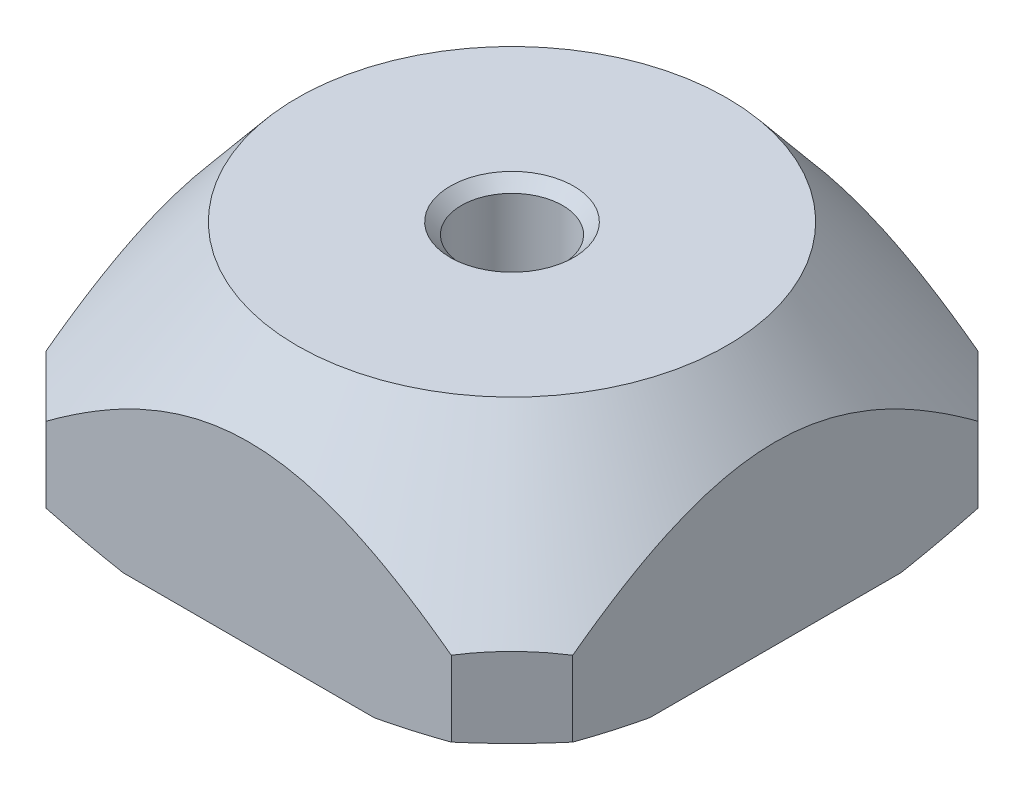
ISO-10303-21;
HEADER;
FILE_DESCRIPTION(('STEP AP214'),'2;1');
FILE_NAME('part.step','',(''),(''),'','','');
FILE_SCHEMA(('AUTOMOTIVE_DESIGN { 1 0 10303 214 1 1 1 1 }'));
ENDSEC;
DATA;
#1=APPLICATION_CONTEXT('core data for automotive mechanical design processes');
#2=APPLICATION_PROTOCOL_DEFINITION('international standard','automotive_design',2000,#1);
#3=PRODUCT_CONTEXT('',#1,'mechanical');
#4=PRODUCT('Part','Part','',(#3));
#5=PRODUCT_RELATED_PRODUCT_CATEGORY('part','',(#4));
#6=PRODUCT_DEFINITION_FORMATION('','',#4);
#7=PRODUCT_DEFINITION_CONTEXT('part definition',#1,'design');
#8=PRODUCT_DEFINITION('design','',#6,#7);
#9=PRODUCT_DEFINITION_SHAPE('','',#8);
#10=(LENGTH_UNIT() NAMED_UNIT(*) SI_UNIT(.MILLI.,.METRE.));
#11=(NAMED_UNIT(*) PLANE_ANGLE_UNIT() SI_UNIT($,.RADIAN.));
#12=(NAMED_UNIT(*) SI_UNIT($,.STERADIAN.) SOLID_ANGLE_UNIT());
#13=UNCERTAINTY_MEASURE_WITH_UNIT(LENGTH_MEASURE(1.E-05),#10,'distance_accuracy_value','');
#14=(GEOMETRIC_REPRESENTATION_CONTEXT(3) GLOBAL_UNCERTAINTY_ASSIGNED_CONTEXT((#13)) GLOBAL_UNIT_ASSIGNED_CONTEXT((#10,
#11,#12)) REPRESENTATION_CONTEXT('',''));
#15=CARTESIAN_POINT('',(0.,0.,0.));
#16=DIRECTION('',(0.,0.,1.));
#17=DIRECTION('',(1.,0.,0.));
#18=AXIS2_PLACEMENT_3D('',#15,#16,#17);
#19=CARTESIAN_POINT('',(0.,5.8,0.));
#20=DIRECTION('',(0.,-1.,0.));
#21=DIRECTION('',(0.,0.,-1.));
#22=AXIS2_PLACEMENT_3D('',#19,#20,#21);
#23=PLANE('',#22);
#24=CARTESIAN_POINT('',(0.,5.8,0.));
#25=DIRECTION('',(0.,-1.,0.));
#26=DIRECTION('',(0.,0.,-1.));
#27=AXIS2_PLACEMENT_3D('',#24,#25,#26);
#28=CIRCLE('',#27,5.3);
#29=CARTESIAN_POINT('',(0.,5.8,-5.3));
#30=VERTEX_POINT('',#29);
#31=EDGE_CURVE('E445',#30,#30,#28,.T.);
#32=ORIENTED_EDGE('',*,*,#31,.F.);
#33=EDGE_LOOP('',(#32));
#34=FACE_BOUND('',#33,.T.);
#35=CARTESIAN_POINT('',(0.,5.80000000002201,0.));
#36=DIRECTION('',(0.,1.,0.));
#37=DIRECTION('',(0.,0.,1.));
#38=AXIS2_PLACEMENT_3D('',#35,#36,#37);
#39=CIRCLE('',#38,1.5250000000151);
#40=CARTESIAN_POINT('',(0.,5.80000000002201,1.5250000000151));
#41=VERTEX_POINT('',#40);
#42=EDGE_CURVE('E19',#41,#41,#39,.F.);
#43=ORIENTED_EDGE('',*,*,#42,.T.);
#44=EDGE_LOOP('',(#43));
#45=FACE_BOUND('',#44,.T.);
#46=ADVANCED_FACE('F16',(#34,#45),#23,.F.);
#47=CARTESIAN_POINT('',(0.,5.79999999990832,0.));
#48=DIRECTION('',(0.,1.,0.));
#49=DIRECTION('',(0.,0.,1.));
#50=AXIS2_PLACEMENT_3D('',#47,#48,#49);
#51=CONICAL_SURFACE('',#50,1.52499999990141,0.785398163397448);
#52=ORIENTED_EDGE('',*,*,#42,.F.);
#53=EDGE_LOOP('',(#52));
#54=FACE_BOUND('',#53,.T.);
#55=CARTESIAN_POINT('',(0.,5.525,0.));
#56=DIRECTION('',(0.,1.,0.));
#57=DIRECTION('',(0.,0.,1.));
#58=AXIS2_PLACEMENT_3D('',#55,#56,#57);
#59=CIRCLE('',#58,1.25);
#60=CARTESIAN_POINT('',(0.,5.525,1.25));
#61=VERTEX_POINT('',#60);
#62=EDGE_CURVE('E147',#61,#61,#59,.F.);
#63=ORIENTED_EDGE('',*,*,#62,.T.);
#64=EDGE_LOOP('',(#63));
#65=FACE_BOUND('',#64,.T.);
#66=ADVANCED_FACE('F355',(#54,#65),#51,.F.);
#67=CARTESIAN_POINT('',(5.00093362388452,37.1474583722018,-6.5));
#68=DIRECTION('',(0.707106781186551,0.,-0.707106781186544));
#69=DIRECTION('',(-0.707106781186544,0.,-0.707106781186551));
#70=AXIS2_PLACEMENT_3D('',#67,#68,#69);
#71=PLANE('',#70);
#72=DIRECTION('',(0.,1.,0.));
#73=VECTOR('',#72,1.);
#74=CARTESIAN_POINT('',(5.00093362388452,5.8,-6.5));
#75=LINE('',#74,#73);
#76=CARTESIAN_POINT('',(5.00093356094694,0.429511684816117,-6.50000006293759));
#77=VERTEX_POINT('',#76);
#78=CARTESIAN_POINT('',(5.00093364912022,2.28669481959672,-6.49999997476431));
#79=VERTEX_POINT('',#78);
#80=EDGE_CURVE('E108',#77,#79,#75,.T.);
#81=ORIENTED_EDGE('',*,*,#80,.T.);
#82=CARTESIAN_POINT('',(6.50000003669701,2.28669480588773,-5.0009335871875));
#83=CARTESIAN_POINT('',(6.43784742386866,2.30045539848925,-5.06308620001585));
#84=CARTESIAN_POINT('',(6.37551621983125,2.31256643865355,-5.12541740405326));
#85=CARTESIAN_POINT('',(6.25056780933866,2.33340084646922,-5.25036581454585));
#86=CARTESIAN_POINT('',(6.18795058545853,2.34212400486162,-5.31298303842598));
#87=CARTESIAN_POINT('',(6.00058150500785,2.36298820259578,-5.50035211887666));
#88=CARTESIAN_POINT('',(5.87552418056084,2.36999999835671,-5.62540944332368));
#89=CARTESIAN_POINT('',(5.62540953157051,2.3700000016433,-5.87552409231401));
#90=CARTESIAN_POINT('',(5.5003522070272,2.36298820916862,-6.00058141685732));
#91=CARTESIAN_POINT('',(5.31298312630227,2.34212401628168,-6.18795049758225));
#92=CARTESIAN_POINT('',(5.25036590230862,2.33340085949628,-6.25056772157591));
#93=CARTESIAN_POINT('',(5.12541749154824,2.31256645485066,-6.37551613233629));
#94=CARTESIAN_POINT('',(5.06308628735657,2.30045541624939,-6.43784733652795));
#95=CARTESIAN_POINT('',(5.00093367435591,2.28669482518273,-6.49999994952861));
#96=B_SPLINE_CURVE_WITH_KNOTS('',3,(#82,#83,#84,#85,#86,#87,#88,#89,#90,#91,#92,#93,#94,#95),
.UNSPECIFIED.,.F.,.F.,(4,2,2,2,2,2,4),(0.,0.26687453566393,0.533765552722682,1.06417199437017,
1.59457843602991,1.86146945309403,2.12834398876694),.UNSPECIFIED.);
#97=CARTESIAN_POINT('',(6.5000000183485,2.28669481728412,-5.00093359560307));
#98=VERTEX_POINT('',#97);
#99=EDGE_CURVE('E101',#98,#79,#96,.T.);
#100=ORIENTED_EDGE('',*,*,#99,.F.);
#101=DIRECTION('',(0.,1.,0.));
#102=VECTOR('',#101,1.);
#103=CARTESIAN_POINT('',(6.5,5.8,-5.00093362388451));
#104=LINE('',#103,#102);
#105=CARTESIAN_POINT('',(6.50000003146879,0.429511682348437,-5.00093359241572));
#106=VERTEX_POINT('',#105);
#107=EDGE_CURVE('E106',#98,#106,#104,.F.);
#108=ORIENTED_EDGE('',*,*,#107,.T.);
#109=CARTESIAN_POINT('',(5.00093349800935,0.429511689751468,-6.50000012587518));
#110=CARTESIAN_POINT('',(5.12577543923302,0.419709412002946,-6.37515818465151));
#111=CARTESIAN_POINT('',(5.25071389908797,0.412329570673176,-6.25021972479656));
#112=CARTESIAN_POINT('',(5.50059054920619,0.402476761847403,-6.00034307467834));
#113=CARTESIAN_POINT('',(5.62552866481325,0.400000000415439,-5.87540495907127));
#114=CARTESIAN_POINT('',(5.8754048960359,0.399999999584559,-5.62552872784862));
#115=CARTESIAN_POINT('',(6.00034301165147,0.40247676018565,-5.50059061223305));
#116=CARTESIAN_POINT('',(6.25021966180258,0.412329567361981,-5.25071396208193));
#117=CARTESIAN_POINT('',(6.37515812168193,0.419709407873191,-5.12577550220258));
#118=CARTESIAN_POINT('',(6.50000006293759,0.429511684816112,-5.00093356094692));
#119=B_SPLINE_CURVE_WITH_KNOTS('',3,(#109,#110,#111,#112,#113,#114,#115,#116,#117,#118),
.UNSPECIFIED.,.F.,.F.,(4,2,2,2,4),(0.,0.530461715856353,1.06051280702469,1.59056389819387,
2.12102561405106),.UNSPECIFIED.);
#120=EDGE_CURVE('E138',#77,#106,#119,.T.);
#121=ORIENTED_EDGE('',*,*,#120,.F.);
#122=EDGE_LOOP('',(#81,#100,#108,#121));
#123=FACE_BOUND('',#122,.T.);
#124=ADVANCED_FACE('F103',(#123),#71,.T.);
#125=CARTESIAN_POINT('',(6.50000000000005,29.8974583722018,5.00093362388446));
#126=DIRECTION('',(0.707106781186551,0.,0.707106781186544));
#127=DIRECTION('',(0.707106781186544,0.,-0.707106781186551));
#128=AXIS2_PLACEMENT_3D('',#125,#126,#127);
#129=PLANE('',#128);
#130=DIRECTION('',(0.,1.,0.));
#131=VECTOR('',#130,1.);
#132=CARTESIAN_POINT('',(6.5,5.8,5.00093362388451));
#133=LINE('',#132,#131);
#134=CARTESIAN_POINT('',(6.50000006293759,0.429511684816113,5.00093356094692));
#135=VERTEX_POINT('',#134);
#136=CARTESIAN_POINT('',(6.5,2.28669481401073,5.00093362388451));
#137=VERTEX_POINT('',#136);
#138=EDGE_CURVE('E120',#135,#137,#133,.T.);
#139=ORIENTED_EDGE('',*,*,#138,.T.);
#140=CARTESIAN_POINT('',(6.5,2.28669481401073,5.00093362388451));
#141=CARTESIAN_POINT('',(6.43784738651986,2.30045540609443,5.06308623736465));
#142=CARTESIAN_POINT('',(6.37551618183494,2.31256644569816,5.12541744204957));
#143=CARTESIAN_POINT('',(6.25056777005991,2.33340085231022,5.25036585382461));
#144=CARTESIAN_POINT('',(6.18795054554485,2.34212401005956,5.31298307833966));
#145=CARTESIAN_POINT('',(6.00058146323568,2.36298820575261,5.50035216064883));
#146=CARTESIAN_POINT('',(5.87552413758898,2.37,5.62540948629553));
#147=CARTESIAN_POINT('',(5.62540948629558,2.37,5.87552413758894));
#148=CARTESIAN_POINT('',(5.50035216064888,2.36298820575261,6.00058146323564));
#149=CARTESIAN_POINT('',(5.31298307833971,2.34212401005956,6.18795054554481));
#150=CARTESIAN_POINT('',(5.25036585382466,2.33340085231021,6.25056777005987));
#151=CARTESIAN_POINT('',(5.12541744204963,2.31256644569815,6.3755161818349));
#152=CARTESIAN_POINT('',(5.0630862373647,2.30045540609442,6.43784738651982));
#153=CARTESIAN_POINT('',(5.00093362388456,2.28669481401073,6.49999999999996));
#154=B_SPLINE_CURVE_WITH_KNOTS('',3,(#140,#141,#142,#143,#144,#145,#146,#147,#148,#149,#150,
#151,#152,#153),.UNSPECIFIED.,.F.,.F.,(4,2,2,2,2,2,4),(0.,0.266874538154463,0.533765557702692,
1.06417200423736,1.59457845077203,1.86146947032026,2.12834400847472),.UNSPECIFIED.);
#155=CARTESIAN_POINT('',(5.00093362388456,2.28669481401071,6.49999999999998));
#156=VERTEX_POINT('',#155);
#157=EDGE_CURVE('E111',#137,#156,#154,.T.);
#158=ORIENTED_EDGE('',*,*,#157,.T.);
#159=DIRECTION('',(0.,1.,0.));
#160=VECTOR('',#159,1.);
#161=CARTESIAN_POINT('',(5.00093362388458,5.8,6.5));
#162=LINE('',#161,#160);
#163=CARTESIAN_POINT('',(5.00093359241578,0.429511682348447,6.50000003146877));
#164=VERTEX_POINT('',#163);
#165=EDGE_CURVE('E257',#156,#164,#162,.F.);
#166=ORIENTED_EDGE('',*,*,#165,.T.);
#167=CARTESIAN_POINT('',(6.50000012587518,0.429511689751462,5.00093349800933));
#168=CARTESIAN_POINT('',(6.37515818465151,0.419709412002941,5.125775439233));
#169=CARTESIAN_POINT('',(6.25021972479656,0.412329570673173,5.25071389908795));
#170=CARTESIAN_POINT('',(6.00034307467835,0.402476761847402,5.50059054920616));
#171=CARTESIAN_POINT('',(5.87540495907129,0.400000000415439,5.62552866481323));
#172=CARTESIAN_POINT('',(5.62552872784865,0.39999999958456,5.87540489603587));
#173=CARTESIAN_POINT('',(5.50059061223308,0.402476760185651,6.00034301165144));
#174=CARTESIAN_POINT('',(5.25071396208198,0.412329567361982,6.25021966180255));
#175=CARTESIAN_POINT('',(5.12577550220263,0.419709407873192,6.3751581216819));
#176=CARTESIAN_POINT('',(5.00093356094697,0.429511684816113,6.50000006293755));
#177=B_SPLINE_CURVE_WITH_KNOTS('',3,(#167,#168,#169,#170,#171,#172,#173,#174,#175,#176),
.UNSPECIFIED.,.F.,.F.,(4,2,2,2,4),(0.,0.530461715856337,1.06051280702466,1.59056389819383,
2.121025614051),.UNSPECIFIED.);
#178=EDGE_CURVE('E272',#135,#164,#177,.T.);
#179=ORIENTED_EDGE('',*,*,#178,.F.);
#180=EDGE_LOOP('',(#139,#158,#166,#179));
#181=FACE_BOUND('',#180,.T.);
#182=ADVANCED_FACE('F327',(#181),#129,.T.);
#183=CARTESIAN_POINT('',(0.,2.26561498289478,0.));
#184=DIRECTION('',(0.,-1.,0.));
#185=DIRECTION('',(0.,0.,-1.));
#186=AXIS2_PLACEMENT_3D('',#183,#184,#185);
#187=CONICAL_SURFACE('',#186,8.218586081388,0.690257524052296);
#188=ORIENTED_EDGE('',*,*,#31,.T.);
#189=EDGE_LOOP('',(#188));
#190=FACE_BOUND('',#189,.T.);
#191=CARTESIAN_POINT('',(-5.00093362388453,2.28669481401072,6.5));
#192=CARTESIAN_POINT('',(-5.06308623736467,2.30045540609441,6.43784738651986));
#193=CARTESIAN_POINT('',(-5.12541744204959,2.31256644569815,6.37551618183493));
#194=CARTESIAN_POINT('',(-5.25036585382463,2.33340085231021,6.2505677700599));
#195=CARTESIAN_POINT('',(-5.31298307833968,2.34212401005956,6.18795054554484));
#196=CARTESIAN_POINT('',(-5.50035216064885,2.3629882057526,6.00058146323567));
#197=CARTESIAN_POINT('',(-5.62540948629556,2.37,5.87552413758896));
#198=CARTESIAN_POINT('',(-5.87552413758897,2.37000000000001,5.62540948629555));
#199=CARTESIAN_POINT('',(-6.00058146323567,2.36298820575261,5.50035216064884));
#200=CARTESIAN_POINT('',(-6.18795054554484,2.34212401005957,5.31298307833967));
#201=CARTESIAN_POINT('',(-6.2505677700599,2.33340085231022,5.25036585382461));
#202=CARTESIAN_POINT('',(-6.37551618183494,2.31256644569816,5.12541744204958));
#203=CARTESIAN_POINT('',(-6.43784738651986,2.30045540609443,5.06308623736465));
#204=CARTESIAN_POINT('',(-6.5,2.28669481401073,5.00093362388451));
#205=B_SPLINE_CURVE_WITH_KNOTS('',3,(#191,#192,#193,#194,#195,#196,#197,#198,#199,#200,#201,
#202,#203,#204),.UNSPECIFIED.,.F.,.F.,(4,2,2,2,2,2,4),(0.,0.26687453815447,0.533765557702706,
1.06417200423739,1.59457845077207,1.8614694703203,2.12834400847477),.UNSPECIFIED.);
#206=CARTESIAN_POINT('',(-5.00093362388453,2.28669481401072,6.5));
#207=VERTEX_POINT('',#206);
#208=CARTESIAN_POINT('',(-6.5,2.28669481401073,5.00093362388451));
#209=VERTEX_POINT('',#208);
#210=EDGE_CURVE('E333',#207,#209,#205,.T.);
#211=ORIENTED_EDGE('',*,*,#210,.F.);
#212=CARTESIAN_POINT('',(-5.00093362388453,2.28669481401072,6.5));
#213=CARTESIAN_POINT('',(-4.89461882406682,2.36519488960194,6.5));
#214=CARTESIAN_POINT('',(-4.78756060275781,2.44268666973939,6.5));
#215=CARTESIAN_POINT('',(-4.57178170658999,2.59536506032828,6.5));
#216=CARTESIAN_POINT('',(-4.46306069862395,2.67055119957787,6.5));
#217=CARTESIAN_POINT('',(-4.13342181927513,2.89269870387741,6.5));
#218=CARTESIAN_POINT('',(-3.90978571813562,3.03568366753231,6.5));
#219=CARTESIAN_POINT('',(-3.4465789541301,3.31215846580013,6.5));
#220=CARTESIAN_POINT('',(-3.20672602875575,3.44517986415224,6.5));
#221=CARTESIAN_POINT('',(-2.7170779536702,3.69103259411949,6.5));
#222=CARTESIAN_POINT('',(-2.46729714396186,3.80389183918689,6.5));
#223=CARTESIAN_POINT('',(-2.03482702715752,3.97262521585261,6.5));
#224=CARTESIAN_POINT('',(-1.85483896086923,4.03539099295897,6.5));
#225=CARTESIAN_POINT('',(-1.49011877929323,4.14544511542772,6.5));
#226=CARTESIAN_POINT('',(-1.30538676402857,4.19273378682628,6.5));
#227=CARTESIAN_POINT('',(-0.934834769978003,4.26884620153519,6.5));
#228=CARTESIAN_POINT('',(-0.749067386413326,4.29792233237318,6.5));
#229=CARTESIAN_POINT('',(-0.375528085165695,4.33690000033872,6.5));
#230=CARTESIAN_POINT('',(-0.187756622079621,4.34680579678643,6.5));
#231=CARTESIAN_POINT('',(0.16789069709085,4.34681251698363,6.5));
#232=CARTESIAN_POINT('',(0.335769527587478,4.33889803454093,6.5));
#233=CARTESIAN_POINT('',(0.670076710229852,4.30766815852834,6.5));
#234=CARTESIAN_POINT('',(0.836505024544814,4.28435236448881,6.5));
#235=CARTESIAN_POINT('',(1.16887468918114,4.22305769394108,6.5));
#236=CARTESIAN_POINT('',(1.3347807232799,4.18488964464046,6.5));
#237=CARTESIAN_POINT('',(1.66300269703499,4.09557989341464,6.5));
#238=CARTESIAN_POINT('',(1.82531875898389,4.04443863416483,6.5));
#239=CARTESIAN_POINT('',(2.26283278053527,3.88965064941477,6.5));
#240=CARTESIAN_POINT('',(2.53410341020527,3.77489830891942,6.5));
#241=CARTESIAN_POINT('',(3.06513239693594,3.5205626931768,6.5));
#242=CARTESIAN_POINT('',(3.32486424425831,3.38092559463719,6.5));
#243=CARTESIAN_POINT('',(3.702501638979,3.16031756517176,6.5));
#244=CARTESIAN_POINT('',(3.82449988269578,3.08620976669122,6.5));
#245=CARTESIAN_POINT('',(4.06621203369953,2.93433161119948,6.5));
#246=CARTESIAN_POINT('',(4.18592578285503,2.85656100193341,6.5));
#247=CARTESIAN_POINT('',(4.422624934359,2.69829475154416,6.5));
#248=CARTESIAN_POINT('',(4.53962131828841,2.6178154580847,6.5));
#249=CARTESIAN_POINT('',(4.77167680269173,2.45417264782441,6.5));
#250=CARTESIAN_POINT('',(4.88673641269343,2.37100985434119,6.5));
#251=CARTESIAN_POINT('',(5.00093362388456,2.2866948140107,6.5));
#252=B_SPLINE_CURVE_WITH_KNOTS('',3,(#212,#213,#214,#215,#216,#217,#218,#219,#220,#221,#222,
#223,#224,#225,#226,#227,#228,#229,#230,#231,#232,#233,#234,#235,#236,#237,#238,#239,#240,#241,
#242,#243,#244,#245,#246,#247,#248,#249,#250,#251),.UNSPECIFIED.,.F.,.F.,(4,2,2,2,2,2,2,2,2,2,2,
2,2,2,2,2,2,2,2,4),(0.,0.396455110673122,0.792990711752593,1.58889552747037,2.41103939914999,
3.23203608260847,3.80332089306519,4.37459366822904,4.93776368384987,5.50080855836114,
6.00427946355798,6.50776346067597,7.01788207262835,7.52798328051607,8.40977024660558,
9.29348810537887,9.72166656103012,10.1498745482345,10.5758468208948,11.0017052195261),.UNSPECIFIED.);
#253=EDGE_CURVE('E258',#207,#156,#252,.T.);
#254=ORIENTED_EDGE('',*,*,#253,.T.);
#255=ORIENTED_EDGE('',*,*,#157,.F.);
#256=CARTESIAN_POINT('',(6.5,2.28669481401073,5.00093362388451));
#257=CARTESIAN_POINT('',(6.5,2.36546542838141,4.89425230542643));
#258=CARTESIAN_POINT('',(6.5,2.44322075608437,4.78682264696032));
#259=CARTESIAN_POINT('',(6.5,2.59640967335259,4.57028828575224));
#260=CARTESIAN_POINT('',(6.5,2.67184277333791,4.46118323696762));
#261=CARTESIAN_POINT('',(6.5,2.89472597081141,4.13033374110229));
#262=CARTESIAN_POINT('',(6.5,3.03816727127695,3.90584895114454));
#263=CARTESIAN_POINT('',(6.5,3.31446263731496,3.44248350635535));
#264=CARTESIAN_POINT('',(6.5,3.44694761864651,3.20338079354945));
#265=CARTESIAN_POINT('',(6.5,3.69182258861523,2.71532773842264));
#266=CARTESIAN_POINT('',(6.5,3.80424366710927,2.46639337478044));
#267=CARTESIAN_POINT('',(6.5,3.96403148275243,2.05685433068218));
#268=CARTESIAN_POINT('',(6.5,4.01970687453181,1.89949160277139));
#269=CARTESIAN_POINT('',(6.5,4.11943260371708,1.58107070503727));
#270=CARTESIAN_POINT('',(6.5,4.16348252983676,1.42001240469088));
#271=CARTESIAN_POINT('',(6.5,4.23795252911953,1.09621460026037));
#272=CARTESIAN_POINT('',(6.5,4.26848771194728,0.93350186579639));
#273=CARTESIAN_POINT('',(6.5,4.31512465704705,0.606006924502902));
#274=CARTESIAN_POINT('',(6.5,4.33122767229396,0.441224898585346));
#275=CARTESIAN_POINT('',(6.5,4.34827314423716,0.109455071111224));
#276=CARTESIAN_POINT('',(6.5,4.34908501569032,-0.0575395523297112));
#277=CARTESIAN_POINT('',(6.5,4.33517110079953,-0.390873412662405));
#278=CARTESIAN_POINT('',(6.5,4.32044494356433,-0.557212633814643));
#279=CARTESIAN_POINT('',(6.5,4.2761251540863,-0.88848991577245));
#280=CARTESIAN_POINT('',(6.5,4.24647760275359,-1.05342067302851));
#281=CARTESIAN_POINT('',(6.5,4.17365597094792,-1.3802445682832));
#282=CARTESIAN_POINT('',(6.5,4.13047995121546,-1.54213726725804));
#283=CARTESIAN_POINT('',(6.5,4.00941900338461,-1.93674499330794));
#284=CARTESIAN_POINT('',(6.5,3.92473121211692,-2.16737187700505));
#285=CARTESIAN_POINT('',(6.5,3.73524387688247,-2.62020320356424));
#286=CARTESIAN_POINT('',(6.5,3.6304297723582,-2.84240140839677));
#287=CARTESIAN_POINT('',(6.5,3.40508735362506,-3.27921361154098));
#288=CARTESIAN_POINT('',(6.5,3.2845244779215,-3.49380956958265));
#289=CARTESIAN_POINT('',(6.5,3.03152298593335,-3.91571764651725));
#290=CARTESIAN_POINT('',(6.5,2.89908838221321,-4.12303219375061));
#291=CARTESIAN_POINT('',(6.5,2.68529870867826,-4.44159950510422));
#292=CARTESIAN_POINT('',(6.5,2.60709917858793,-4.55499497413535));
#293=CARTESIAN_POINT('',(6.5,2.44851798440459,-4.77950010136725));
#294=CARTESIAN_POINT('',(6.5,2.36814750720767,-4.89061765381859));
#295=CARTESIAN_POINT('',(6.5,2.28669482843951,-5.00093360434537));
#296=B_SPLINE_CURVE_WITH_KNOTS('',3,(#256,#257,#258,#259,#260,#261,#262,#263,#264,#265,#266,
#267,#268,#269,#270,#271,#272,#273,#274,#275,#276,#277,#278,#279,#280,#281,#282,#283,#284,#285,
#286,#287,#288,#289,#290,#291,#292,#293,#294,#295),.UNSPECIFIED.,.F.,.F.,(4,2,2,2,2,2,2,2,2,2,2,
2,2,2,2,2,2,2,2,4),(0.,0.39782125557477,0.795725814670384,1.59450470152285,2.41391220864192,
3.23203877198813,3.7324336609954,4.23284625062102,4.72891053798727,5.22493175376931,
5.72518705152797,6.22545429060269,6.727542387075,7.2297024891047,7.96546321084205,
8.70175824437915,9.43969714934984,10.1773875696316,10.590593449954,11.0019709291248),.UNSPECIFIED.);
#297=EDGE_CURVE('E113',#137,#98,#296,.T.);
#298=ORIENTED_EDGE('',*,*,#297,.T.);
#299=ORIENTED_EDGE('',*,*,#99,.T.);
#300=CARTESIAN_POINT('',(5.00093365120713,2.28669479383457,-6.5));
#301=CARTESIAN_POINT('',(4.89461885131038,2.36519486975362,-6.5));
#302=CARTESIAN_POINT('',(4.78756062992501,2.442686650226,-6.5));
#303=CARTESIAN_POINT('',(4.57178173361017,2.59536504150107,-6.5));
#304=CARTESIAN_POINT('',(4.46306072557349,2.67055118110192,-6.5));
#305=CARTESIAN_POINT('',(4.13342184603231,2.89269868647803,-6.5));
#306=CARTESIAN_POINT('',(3.90978574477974,3.03568365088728,-6.5));
#307=CARTESIAN_POINT('',(3.44657898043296,3.31215845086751,-6.5));
#308=CARTESIAN_POINT('',(3.20672605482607,3.44517985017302,-6.5));
#309=CARTESIAN_POINT('',(2.71707797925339,3.69103258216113,-6.5));
#310=CARTESIAN_POINT('',(2.46729716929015,3.80389182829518,-6.5));
#311=CARTESIAN_POINT('',(2.03482705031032,3.97262520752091,-6.5));
#312=CARTESIAN_POINT('',(1.85483898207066,4.0353909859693,-6.5));
#313=CARTESIAN_POINT('',(1.49011879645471,4.1454451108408,-6.5));
#314=CARTESIAN_POINT('',(1.30538677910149,4.19273378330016,-6.5));
#315=CARTESIAN_POINT('',(0.934834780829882,4.26884619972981,-6.5));
#316=CARTESIAN_POINT('',(0.749067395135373,4.29792233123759,-6.5));
#317=CARTESIAN_POINT('',(0.37552808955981,4.33690000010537,-6.5));
#318=CARTESIAN_POINT('',(0.18775662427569,4.34680579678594,-6.5));
#319=CARTESIAN_POINT('',(-0.167890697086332,4.34681251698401,-6.5));
#320=CARTESIAN_POINT('',(-0.335769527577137,4.33889803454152,-6.5));
#321=CARTESIAN_POINT('',(-0.67007671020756,4.30766815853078,-6.5));
#322=CARTESIAN_POINT('',(-0.836505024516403,4.28435236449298,-6.5));
#323=CARTESIAN_POINT('',(-1.16887468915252,4.22305769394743,-6.5));
#324=CARTESIAN_POINT('',(-1.33478072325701,4.1848896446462,-6.5));
#325=CARTESIAN_POINT('',(-1.66300269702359,4.09557989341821,-6.5));
#326=CARTESIAN_POINT('',(-1.82531875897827,4.04443863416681,-6.5));
#327=CARTESIAN_POINT('',(-2.26283278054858,3.88965064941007,-6.5));
#328=CARTESIAN_POINT('',(-2.53410341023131,3.77489830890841,-6.5));
#329=CARTESIAN_POINT('',(-3.06513239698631,3.52056269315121,-6.5));
#330=CARTESIAN_POINT('',(-3.32486424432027,3.38092559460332,-6.5));
#331=CARTESIAN_POINT('',(-3.7025016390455,3.16031756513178,-6.5));
#332=CARTESIAN_POINT('',(-3.82449988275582,3.08620976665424,-6.5));
#333=CARTESIAN_POINT('',(-4.0662120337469,2.93433161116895,-6.5));
#334=CARTESIAN_POINT('',(-4.18592578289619,2.85656100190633,-6.5));
#335=CARTESIAN_POINT('',(-4.422624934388,2.69829475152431,-6.5));
#336=CARTESIAN_POINT('',(-4.53962131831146,2.61781545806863,-6.5));
#337=CARTESIAN_POINT('',(-4.77167680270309,2.45417264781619,-6.5));
#338=CARTESIAN_POINT('',(-4.88673641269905,2.37100985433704,-6.5));
#339=CARTESIAN_POINT('',(-5.00093362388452,2.28669481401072,-6.5));
#340=B_SPLINE_CURVE_WITH_KNOTS('',3,(#300,#301,#302,#303,#304,#305,#306,#307,#308,#309,#310,
#311,#312,#313,#314,#315,#316,#317,#318,#319,#320,#321,#322,#323,#324,#325,#326,#327,#328,#329,
#330,#331,#332,#333,#334,#335,#336,#337,#338,#339),.UNSPECIFIED.,.F.,.F.,(4,2,2,2,2,2,2,2,2,2,2,
2,2,2,2,2,2,2,2,4),(0.,0.396455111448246,0.792990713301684,1.5888955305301,2.41103940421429,
3.23203608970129,3.80332090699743,4.37459368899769,4.93776371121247,5.50080859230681,
6.00427949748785,6.50776349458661,7.01788210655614,7.52798331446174,8.40977028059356,
9.29348813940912,9.72166659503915,10.1498745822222,10.5758468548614,11.0017052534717),.UNSPECIFIED.);
#341=CARTESIAN_POINT('',(-5.00093362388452,2.28669481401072,-6.5));
#342=VERTEX_POINT('',#341);
#343=EDGE_CURVE('E144',#79,#342,#340,.T.);
#344=ORIENTED_EDGE('',*,*,#343,.T.);
#345=CARTESIAN_POINT('',(-6.5,2.28669481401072,-5.00093362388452));
#346=CARTESIAN_POINT('',(-6.43784738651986,2.30045540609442,-5.06308623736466));
#347=CARTESIAN_POINT('',(-6.37551618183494,2.31256644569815,-5.12541744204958));
#348=CARTESIAN_POINT('',(-6.2505677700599,2.33340085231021,-5.25036585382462));
#349=CARTESIAN_POINT('',(-6.18795054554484,2.34212401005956,-5.31298307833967));
#350=CARTESIAN_POINT('',(-6.00058146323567,2.36298820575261,-5.50035216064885));
#351=CARTESIAN_POINT('',(-5.87552413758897,2.37,-5.62540948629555));
#352=CARTESIAN_POINT('',(-5.62540948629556,2.37000000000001,-5.87552413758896));
#353=CARTESIAN_POINT('',(-5.50035216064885,2.36298820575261,-6.00058146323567));
#354=CARTESIAN_POINT('',(-5.31298307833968,2.34212401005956,-6.18795054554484));
#355=CARTESIAN_POINT('',(-5.25036585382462,2.33340085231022,-6.2505677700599));
#356=CARTESIAN_POINT('',(-5.12541744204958,2.31256644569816,-6.37551618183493));
#357=CARTESIAN_POINT('',(-5.06308623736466,2.30045540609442,-6.43784738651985));
#358=CARTESIAN_POINT('',(-5.00093362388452,2.28669481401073,-6.5));
#359=B_SPLINE_CURVE_WITH_KNOTS('',3,(#345,#346,#347,#348,#349,#350,#351,#352,#353,#354,#355,
#356,#357,#358),.UNSPECIFIED.,.F.,.F.,(4,2,2,2,2,2,4),(0.,0.26687453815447,0.533765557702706,
1.06417200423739,1.59457845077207,1.8614694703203,2.12834400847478),.UNSPECIFIED.);
#360=CARTESIAN_POINT('',(-6.5,2.28669481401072,-5.00093362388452));
#361=VERTEX_POINT('',#360);
#362=EDGE_CURVE('E150',#361,#342,#359,.T.);
#363=ORIENTED_EDGE('',*,*,#362,.F.);
#364=CARTESIAN_POINT('',(-6.5,2.28669481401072,-5.00093362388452));
#365=CARTESIAN_POINT('',(-6.5,2.36546542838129,-4.89425230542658));
#366=CARTESIAN_POINT('',(-6.5,2.44322075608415,-4.78682264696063));
#367=CARTESIAN_POINT('',(-6.5,2.59640967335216,-4.57028828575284));
#368=CARTESIAN_POINT('',(-6.5,2.67184277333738,-4.46118323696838));
#369=CARTESIAN_POINT('',(-6.5,2.89472597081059,-4.13033374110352));
#370=CARTESIAN_POINT('',(-6.5,3.03816727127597,-3.90584895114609));
#371=CARTESIAN_POINT('',(-6.5,3.31446263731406,-3.44248350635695));
#372=CARTESIAN_POINT('',(-6.5,3.44694761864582,-3.20338079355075));
#373=CARTESIAN_POINT('',(-6.5,3.69182258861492,-2.71532773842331));
#374=CARTESIAN_POINT('',(-6.5,3.80424366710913,-2.46639337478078));
#375=CARTESIAN_POINT('',(-6.5,3.96403148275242,-2.05685433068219));
#376=CARTESIAN_POINT('',(-6.5,4.0197068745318,-1.89949160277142));
#377=CARTESIAN_POINT('',(-6.5,4.11943260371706,-1.58107070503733));
#378=CARTESIAN_POINT('',(-6.5,4.16348252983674,-1.42001240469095));
#379=CARTESIAN_POINT('',(-6.5,4.23795252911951,-1.09621460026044));
#380=CARTESIAN_POINT('',(-6.5,4.26848771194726,-0.933501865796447));
#381=CARTESIAN_POINT('',(-6.5,4.31512465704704,-0.606006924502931));
#382=CARTESIAN_POINT('',(-6.5,4.33122767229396,-0.441224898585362));
#383=CARTESIAN_POINT('',(-6.5,4.34827314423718,-0.109455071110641));
#384=CARTESIAN_POINT('',(-6.5,4.34908501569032,0.0575395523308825));
#385=CARTESIAN_POINT('',(-6.5,4.33517110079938,0.390873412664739));
#386=CARTESIAN_POINT('',(-6.5,4.32044494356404,0.557212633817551));
#387=CARTESIAN_POINT('',(-6.5,4.2761251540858,0.888489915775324));
#388=CARTESIAN_POINT('',(-6.5,4.24647760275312,1.05342067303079));
#389=CARTESIAN_POINT('',(-6.5,4.17365597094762,1.38024456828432));
#390=CARTESIAN_POINT('',(-6.5,4.13047995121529,1.5421372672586));
#391=CARTESIAN_POINT('',(-6.5,4.00941900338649,1.93674499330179));
#392=CARTESIAN_POINT('',(-6.5,3.92473121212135,2.16737187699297));
#393=CARTESIAN_POINT('',(-6.5,3.73524387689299,2.62020320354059));
#394=CARTESIAN_POINT('',(-6.5,3.63042977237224,2.8424014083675));
#395=CARTESIAN_POINT('',(-6.5,3.40508735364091,3.2792136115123));
#396=CARTESIAN_POINT('',(-6.5,3.2845244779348,3.49380956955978));
#397=CARTESIAN_POINT('',(-6.5,3.03152298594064,3.91571764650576));
#398=CARTESIAN_POINT('',(-6.5,2.89908838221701,4.1230321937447));
#399=CARTESIAN_POINT('',(-6.5,2.68529870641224,4.44159950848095));
#400=CARTESIAN_POINT('',(-6.5,2.6070991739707,4.55499498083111));
#401=CARTESIAN_POINT('',(-6.5,2.44851797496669,4.77950011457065));
#402=CARTESIAN_POINT('',(-6.5,2.36814749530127,4.89061767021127));
#403=CARTESIAN_POINT('',(-6.5,2.28669481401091,5.00093362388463));
#404=B_SPLINE_CURVE_WITH_KNOTS('',3,(#364,#365,#366,#367,#368,#369,#370,#371,#372,#373,#374,
#375,#376,#377,#378,#379,#380,#381,#382,#383,#384,#385,#386,#387,#388,#389,#390,#391,#392,#393,
#394,#395,#396,#397,#398,#399,#400,#401,#402,#403),.UNSPECIFIED.,.F.,.F.,(4,2,2,2,2,2,2,2,2,2,2,
2,2,2,2,2,2,2,2,4),(0.,0.397821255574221,0.795725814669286,1.59450470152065,2.41391220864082,
3.23203877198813,3.73243366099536,4.23284625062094,4.72891053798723,5.22493175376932,
5.72518705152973,6.2254542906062,6.72754238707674,7.22970248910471,7.96546321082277,
8.70175824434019,9.43969714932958,10.1773875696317,10.5905934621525,11.0019709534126),.UNSPECIFIED.);
#405=EDGE_CURVE('E218',#361,#209,#404,.T.);
#406=ORIENTED_EDGE('',*,*,#405,.T.);
#407=EDGE_LOOP('',(#211,#254,#255,#298,#299,#344,#363,#406));
#408=FACE_BOUND('',#407,.T.);
#409=ADVANCED_FACE('F115',(#190,#408),#187,.T.);
#410=CARTESIAN_POINT('',(-5.00093362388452,29.8974583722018,6.5));
#411=DIRECTION('',(-0.707106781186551,0.,0.707106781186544));
#412=DIRECTION('',(0.707106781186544,0.,0.707106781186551));
#413=AXIS2_PLACEMENT_3D('',#410,#411,#412);
#414=PLANE('',#413);
#415=DIRECTION('',(0.,1.,0.));
#416=VECTOR('',#415,1.);
#417=CARTESIAN_POINT('',(-5.00093362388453,5.8,6.5));
#418=LINE('',#417,#416);
#419=CARTESIAN_POINT('',(-5.00093356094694,0.429511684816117,6.50000006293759));
#420=VERTEX_POINT('',#419);
#421=EDGE_CURVE('E134',#420,#207,#418,.T.);
#422=ORIENTED_EDGE('',*,*,#421,.T.);
#423=ORIENTED_EDGE('',*,*,#210,.T.);
#424=DIRECTION('',(0.,1.,0.));
#425=VECTOR('',#424,1.);
#426=CARTESIAN_POINT('',(-6.5,5.8,5.00093362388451));
#427=LINE('',#426,#425);
#428=CARTESIAN_POINT('',(-6.49999996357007,0.429511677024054,5.00093366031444));
#429=VERTEX_POINT('',#428);
#430=EDGE_CURVE('E217',#209,#429,#427,.F.);
#431=ORIENTED_EDGE('',*,*,#430,.T.);
#432=CARTESIAN_POINT('',(-5.00093349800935,0.429511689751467,6.50000012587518));
#433=CARTESIAN_POINT('',(-5.12577542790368,0.419709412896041,6.37515819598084));
#434=CARTESIAN_POINT('',(-5.25071387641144,0.412329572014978,6.25021974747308));
#435=CARTESIAN_POINT('',(-5.50059050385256,0.402476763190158,6.00034312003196));
#436=CARTESIAN_POINT('',(-5.62552860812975,0.400000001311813,5.87540501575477));
#437=CARTESIAN_POINT('',(-5.87540481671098,0.399999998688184,5.62552880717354));
#438=CARTESIAN_POINT('',(-6.00034292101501,0.402476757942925,5.5005907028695));
#439=CARTESIAN_POINT('',(-6.25021954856,0.412329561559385,5.25071407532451));
#440=CARTESIAN_POINT('',(-6.37515799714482,0.419709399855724,5.12577562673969));
#441=CARTESIAN_POINT('',(-6.49999992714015,0.429511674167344,5.00093369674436));
#442=B_SPLINE_CURVE_WITH_KNOTS('',3,(#432,#433,#434,#435,#436,#437,#438,#439,#440,#441),
.UNSPECIFIED.,.F.,.F.,(4,2,2,2,4),(0.,0.530461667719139,1.0605127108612,1.5905637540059,
2.12102542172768),.UNSPECIFIED.);
#443=EDGE_CURVE('E235',#420,#429,#442,.T.);
#444=ORIENTED_EDGE('',*,*,#443,.F.);
#445=EDGE_LOOP('',(#422,#423,#431,#444));
#446=FACE_BOUND('',#445,.T.);
#447=ADVANCED_FACE('F326',(#446),#414,.T.);
#448=CARTESIAN_POINT('',(-6.50000000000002,29.8974583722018,-5.0009336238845));
#449=DIRECTION('',(-0.707106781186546,0.,-0.707106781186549));
#450=DIRECTION('',(-0.707106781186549,0.,0.707106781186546));
#451=AXIS2_PLACEMENT_3D('',#448,#449,#450);
#452=PLANE('',#451);
#453=DIRECTION('',(0.,1.,0.));
#454=VECTOR('',#453,1.);
#455=CARTESIAN_POINT('',(-6.5,5.8,-5.00093362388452));
#456=LINE('',#455,#454);
#457=CARTESIAN_POINT('',(-6.50000006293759,0.429511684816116,-5.00093356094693));
#458=VERTEX_POINT('',#457);
#459=EDGE_CURVE('E395',#458,#361,#456,.T.);
#460=ORIENTED_EDGE('',*,*,#459,.T.);
#461=ORIENTED_EDGE('',*,*,#362,.T.);
#462=DIRECTION('',(0.,1.,0.));
#463=VECTOR('',#462,1.);
#464=CARTESIAN_POINT('',(-5.00093362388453,5.8,-6.5));
#465=LINE('',#464,#463);
#466=CARTESIAN_POINT('',(-5.00093369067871,0.42951169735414,-6.5));
#467=VERTEX_POINT('',#466);
#468=EDGE_CURVE('E139',#342,#467,#465,.F.);
#469=ORIENTED_EDGE('',*,*,#468,.T.);
#470=CARTESIAN_POINT('',(-6.50000012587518,0.429511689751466,-5.00093349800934));
#471=CARTESIAN_POINT('',(-6.37515819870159,0.419709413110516,-5.12577542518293));
#472=CARTESIAN_POINT('',(-6.25021975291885,0.41232957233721,-5.25071387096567));
#473=CARTESIAN_POINT('',(-6.00034313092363,0.40247676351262,-5.50059049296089));
#474=CARTESIAN_POINT('',(-5.87540502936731,0.400000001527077,-5.62552859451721));
#475=CARTESIAN_POINT('',(-5.62552882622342,0.399999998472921,-5.8754047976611));
#476=CARTESIAN_POINT('',(-5.50059072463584,0.402476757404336,-6.00034289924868));
#477=CARTESIAN_POINT('',(-5.2507141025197,0.412329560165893,-6.25021952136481));
#478=CARTESIAN_POINT('',(-5.12577565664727,0.41970939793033,-6.37515796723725));
#479=CARTESIAN_POINT('',(-5.00093372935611,0.429511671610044,-6.49999989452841));
#480=B_SPLINE_CURVE_WITH_KNOTS('',3,(#470,#471,#472,#473,#474,#475,#476,#477,#478,#479),
.UNSPECIFIED.,.F.,.F.,(4,2,2,2,4),(0.,0.530461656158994,1.06051268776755,1.59056371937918,
2.12102537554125),.UNSPECIFIED.);
#481=EDGE_CURVE('E181',#458,#467,#480,.T.);
#482=ORIENTED_EDGE('',*,*,#481,.F.);
#483=EDGE_LOOP('',(#460,#461,#469,#482));
#484=FACE_BOUND('',#483,.T.);
#485=ADVANCED_FACE('F376',(#484),#452,.T.);
#486=CARTESIAN_POINT('',(0.,5.8,0.));
#487=DIRECTION('',(0.,1.,0.));
#488=DIRECTION('',(0.,0.,1.));
#489=AXIS2_PLACEMENT_3D('',#486,#487,#488);
#490=CYLINDRICAL_SURFACE('',#489,1.25);
#491=ORIENTED_EDGE('',*,*,#62,.F.);
#492=EDGE_LOOP('',(#491));
#493=FACE_BOUND('',#492,.T.);
#494=CARTESIAN_POINT('',(0.,0.,0.));
#495=DIRECTION('',(0.,1.,0.));
#496=DIRECTION('',(0.,0.,1.));
#497=AXIS2_PLACEMENT_3D('',#494,#495,#496);
#498=CIRCLE('',#497,1.25);
#499=CARTESIAN_POINT('',(0.,0.,1.25));
#500=VERTEX_POINT('',#499);
#501=EDGE_CURVE('E167',#500,#500,#498,.T.);
#502=ORIENTED_EDGE('',*,*,#501,.F.);
#503=EDGE_LOOP('',(#502));
#504=FACE_BOUND('',#503,.T.);
#505=ADVANCED_FACE('F374',(#493,#504),#490,.F.);
#506=CARTESIAN_POINT('',(-6.5,5.8,-6.5));
#507=DIRECTION('',(0.,0.,1.));
#508=DIRECTION('',(1.,0.,0.));
#509=AXIS2_PLACEMENT_3D('',#506,#507,#508);
#510=PLANE('',#509);
#511=ORIENTED_EDGE('',*,*,#468,.F.);
#512=ORIENTED_EDGE('',*,*,#343,.F.);
#513=ORIENTED_EDGE('',*,*,#80,.F.);
#514=CARTESIAN_POINT('',(3.0967725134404,0.,-6.5));
#515=CARTESIAN_POINT('',(3.25681087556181,0.0295324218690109,-6.5));
#516=CARTESIAN_POINT('',(3.41650959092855,0.0608632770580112,-6.5));
#517=CARTESIAN_POINT('',(3.73518371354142,0.126759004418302,-6.5));
#518=CARTESIAN_POINT('',(3.89415934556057,0.161322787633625,-6.5));
#519=CARTESIAN_POINT('',(4.21144082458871,0.233339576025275,-6.5));
#520=CARTESIAN_POINT('',(4.36974671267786,0.270792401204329,-6.5));
#521=CARTESIAN_POINT('',(4.68578021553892,0.3482890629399,-6.5));
#522=CARTESIAN_POINT('',(4.84350761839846,0.388333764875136,-6.5));
#523=CARTESIAN_POINT('',(5.00093343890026,0.429511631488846,-6.5));
#524=B_SPLINE_CURVE_WITH_KNOTS('',3,(#514,#515,#516,#517,#518,#519,#520,#521,#522,#523),
.UNSPECIFIED.,.F.,.F.,(4,2,2,2,4),(0.,0.488199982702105,0.97623611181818,1.46424185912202,
1.95241139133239),.UNSPECIFIED.);
#525=CARTESIAN_POINT('',(3.0967725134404,0.,-6.5));
#526=VERTEX_POINT('',#525);
#527=EDGE_CURVE('E143',#526,#77,#524,.T.);
#528=ORIENTED_EDGE('',*,*,#527,.F.);
#529=DIRECTION('',(1.,0.,0.));
#530=VECTOR('',#529,1.);
#531=CARTESIAN_POINT('',(0.,0.,-6.5));
#532=LINE('',#531,#530);
#533=CARTESIAN_POINT('',(-3.0967725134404,0.,-6.5));
#534=VERTEX_POINT('',#533);
#535=EDGE_CURVE('E166',#534,#526,#532,.T.);
#536=ORIENTED_EDGE('',*,*,#535,.F.);
#537=CARTESIAN_POINT('',(-5.00093375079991,0.429511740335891,-6.49999996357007));
#538=CARTESIAN_POINT('',(-4.84350790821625,0.388333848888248,-6.4999999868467));
#539=CARTESIAN_POINT('',(-4.68578048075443,0.348289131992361,-6.49999999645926));
#540=CARTESIAN_POINT('',(-4.36974692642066,0.270792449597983,-6.50000000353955));
#541=CARTESIAN_POINT('',(-4.21144101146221,0.233339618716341,-6.50000000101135));
#542=CARTESIAN_POINT('',(-3.89415947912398,0.16132281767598,-6.49999999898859));
#543=CARTESIAN_POINT('',(-3.73518382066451,0.126759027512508,-6.49999999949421));
#544=CARTESIAN_POINT('',(-3.41650964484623,0.0608632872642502,-6.50000000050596));
#545=CARTESIAN_POINT('',(-3.25681090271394,0.0295324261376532,-6.5000000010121));
#546=CARTESIAN_POINT('',(-3.0967725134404,0.,-6.5));
#547=B_SPLINE_CURVE_WITH_KNOTS('',3,(#537,#538,#539,#540,#541,#542,#543,#544,#545,#546),
.UNSPECIFIED.,.F.,.F.,(4,2,2,2,4),(0.,0.488169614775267,0.976175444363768,1.46421165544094,
1.95241172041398),.UNSPECIFIED.);
#548=EDGE_CURVE('E171',#467,#534,#547,.T.);
#549=ORIENTED_EDGE('',*,*,#548,.F.);
#550=EDGE_LOOP('',(#511,#512,#513,#528,#536,#549));
#551=FACE_BOUND('',#550,.T.);
#552=ADVANCED_FACE('F188',(#551),#510,.F.);
#553=CARTESIAN_POINT('',(0.,0.432088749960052,0.));
#554=DIRECTION('',(0.,1.,0.));
#555=DIRECTION('',(0.,0.,1.));
#556=AXIS2_PLACEMENT_3D('',#553,#554,#555);
#557=CONICAL_SURFACE('',#556,8.207186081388,1.1655375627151);
#558=ORIENTED_EDGE('',*,*,#527,.T.);
#559=ORIENTED_EDGE('',*,*,#120,.T.);
#560=CARTESIAN_POINT('',(6.50000003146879,0.429511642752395,-5.0009335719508));
#561=CARTESIAN_POINT('',(6.50000001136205,0.388333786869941,-4.84350773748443));
#562=CARTESIAN_POINT('',(6.50000000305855,0.348289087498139,-4.68578032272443));
#563=CARTESIAN_POINT('',(6.49999999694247,0.27079242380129,-4.36974679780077));
#564=CARTESIAN_POINT('',(6.49999999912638,0.233339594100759,-4.21144089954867));
#565=CARTESIAN_POINT('',(6.50000000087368,0.161322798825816,-3.89415939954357));
#566=CARTESIAN_POINT('',(6.50000000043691,0.126759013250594,-3.73518375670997));
#567=CARTESIAN_POINT('',(6.49999999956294,0.0608632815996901,-3.4165096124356));
#568=CARTESIAN_POINT('',(6.49999999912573,0.0295324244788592,-3.25681088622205));
#569=CARTESIAN_POINT('',(6.5,0.,-3.0967725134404));
#570=B_SPLINE_CURVE_WITH_KNOTS('',3,(#560,#561,#562,#563,#564,#565,#566,#567,#568,#569),
.UNSPECIFIED.,.F.,.F.,(4,2,2,2,4),(0.,0.488169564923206,0.976175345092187,1.46421150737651,
1.95241152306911),.UNSPECIFIED.);
#571=CARTESIAN_POINT('',(6.5,0.,-3.09677251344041));
#572=VERTEX_POINT('',#571);
#573=EDGE_CURVE('E125',#106,#572,#570,.T.);
#574=ORIENTED_EDGE('',*,*,#573,.T.);
#575=CARTESIAN_POINT('',(0.,0.,0.));
#576=DIRECTION('',(0.,1.,0.));
#577=DIRECTION('',(0.,0.,1.));
#578=AXIS2_PLACEMENT_3D('',#575,#576,#577);
#579=CIRCLE('',#578,7.2);
#580=EDGE_CURVE('E162',#526,#572,#579,.F.);
#581=ORIENTED_EDGE('',*,*,#580,.F.);
#582=EDGE_LOOP('',(#558,#559,#574,#581));
#583=FACE_BOUND('',#582,.T.);
#584=ADVANCED_FACE('F294',(#583),#557,.T.);
#585=CARTESIAN_POINT('',(6.5,5.8,6.5));
#586=DIRECTION('',(-1.,0.,0.));
#587=DIRECTION('',(0.,0.,1.));
#588=AXIS2_PLACEMENT_3D('',#585,#586,#587);
#589=PLANE('',#588);
#590=ORIENTED_EDGE('',*,*,#107,.F.);
#591=ORIENTED_EDGE('',*,*,#297,.F.);
#592=ORIENTED_EDGE('',*,*,#138,.F.);
#593=CARTESIAN_POINT('',(6.5,0.,3.09677251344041));
#594=CARTESIAN_POINT('',(6.5,0.0295324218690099,3.25681087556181));
#595=CARTESIAN_POINT('',(6.5,0.06086327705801,3.41650959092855));
#596=CARTESIAN_POINT('',(6.5,0.1267590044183,3.73518371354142));
#597=CARTESIAN_POINT('',(6.5,0.161322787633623,3.89415934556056));
#598=CARTESIAN_POINT('',(6.5,0.233339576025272,4.2114408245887));
#599=CARTESIAN_POINT('',(6.5,0.270792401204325,4.36974671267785));
#600=CARTESIAN_POINT('',(6.5,0.348289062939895,4.68578021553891));
#601=CARTESIAN_POINT('',(6.5,0.388333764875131,4.84350761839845));
#602=CARTESIAN_POINT('',(6.5,0.429511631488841,5.00093343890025));
#603=B_SPLINE_CURVE_WITH_KNOTS('',3,(#593,#594,#595,#596,#597,#598,#599,#600,#601,#602),
.UNSPECIFIED.,.F.,.F.,(4,2,2,2,4),(0.,0.488199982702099,0.976236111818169,1.46424185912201,
1.95241139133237),.UNSPECIFIED.);
#604=CARTESIAN_POINT('',(6.5,0.,3.09677251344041));
#605=VERTEX_POINT('',#604);
#606=EDGE_CURVE('E130',#605,#135,#603,.T.);
#607=ORIENTED_EDGE('',*,*,#606,.F.);
#608=DIRECTION('',(0.,0.,-1.));
#609=VECTOR('',#608,1.);
#610=CARTESIAN_POINT('',(6.5,0.,0.));
#611=LINE('',#610,#609);
#612=EDGE_CURVE('E161',#572,#605,#611,.F.);
#613=ORIENTED_EDGE('',*,*,#612,.F.);
#614=ORIENTED_EDGE('',*,*,#573,.F.);
#615=EDGE_LOOP('',(#590,#591,#592,#607,#613,#614));
#616=FACE_BOUND('',#615,.T.);
#617=ADVANCED_FACE('F123',(#616),#589,.F.);
#618=CARTESIAN_POINT('',(0.,0.432088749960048,0.));
#619=DIRECTION('',(0.,1.,0.));
#620=DIRECTION('',(0.,0.,1.));
#621=AXIS2_PLACEMENT_3D('',#618,#619,#620);
#622=CONICAL_SURFACE('',#621,8.20718608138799,1.1655375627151);
#623=ORIENTED_EDGE('',*,*,#606,.T.);
#624=ORIENTED_EDGE('',*,*,#178,.T.);
#625=CARTESIAN_POINT('',(5.00093356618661,0.429511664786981,6.5));
#626=CARTESIAN_POINT('',(4.84350773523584,0.388333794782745,6.5));
#627=CARTESIAN_POINT('',(4.68578032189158,0.348289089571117,6.5));
#628=CARTESIAN_POINT('',(4.36974679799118,0.270792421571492,6.5));
#629=CARTESIAN_POINT('',(4.21144089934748,0.233339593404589,6.5));
#630=CARTESIAN_POINT('',(3.89415939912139,0.161322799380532,6.5));
#631=CARTESIAN_POINT('',(3.73518375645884,0.126759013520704,6.5));
#632=CARTESIAN_POINT('',(3.41650961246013,0.0608632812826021,6.5));
#633=CARTESIAN_POINT('',(3.25681088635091,0.02953242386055,6.5));
#634=CARTESIAN_POINT('',(3.09677251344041,0.,6.5));
#635=B_SPLINE_CURVE_WITH_KNOTS('',3,(#625,#626,#627,#628,#629,#630,#631,#632,#633,#634),
.UNSPECIFIED.,.F.,.F.,(4,2,2,2,4),(0.,0.488169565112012,0.97617534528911,1.46421150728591,
1.95241152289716),.UNSPECIFIED.);
#636=CARTESIAN_POINT('',(3.09677251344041,0.,6.5));
#637=VERTEX_POINT('',#636);
#638=EDGE_CURVE('E250',#164,#637,#635,.T.);
#639=ORIENTED_EDGE('',*,*,#638,.T.);
#640=CARTESIAN_POINT('',(0.,0.,0.));
#641=DIRECTION('',(0.,1.,0.));
#642=DIRECTION('',(0.,0.,1.));
#643=AXIS2_PLACEMENT_3D('',#640,#641,#642);
#644=CIRCLE('',#643,7.2);
#645=EDGE_CURVE('E157',#605,#637,#644,.F.);
#646=ORIENTED_EDGE('',*,*,#645,.F.);
#647=EDGE_LOOP('',(#623,#624,#639,#646));
#648=FACE_BOUND('',#647,.T.);
#649=ADVANCED_FACE('F264',(#648),#622,.T.);
#650=CARTESIAN_POINT('',(-6.5,5.8,6.5));
#651=DIRECTION('',(0.,0.,-1.));
#652=DIRECTION('',(-1.,0.,0.));
#653=AXIS2_PLACEMENT_3D('',#650,#651,#652);
#654=PLANE('',#653);
#655=ORIENTED_EDGE('',*,*,#165,.F.);
#656=ORIENTED_EDGE('',*,*,#253,.F.);
#657=ORIENTED_EDGE('',*,*,#421,.F.);
#658=CARTESIAN_POINT('',(-3.09677251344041,0.,6.5));
#659=CARTESIAN_POINT('',(-3.25681087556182,0.0295324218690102,6.5));
#660=CARTESIAN_POINT('',(-3.41650959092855,0.0608632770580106,6.5));
#661=CARTESIAN_POINT('',(-3.73518371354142,0.126759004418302,6.5));
#662=CARTESIAN_POINT('',(-3.89415934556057,0.161322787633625,6.5));
#663=CARTESIAN_POINT('',(-4.21144082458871,0.233339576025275,6.5));
#664=CARTESIAN_POINT('',(-4.36974671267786,0.270792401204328,6.5));
#665=CARTESIAN_POINT('',(-4.68578021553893,0.348289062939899,6.5));
#666=CARTESIAN_POINT('',(-4.84350761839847,0.388333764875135,6.5));
#667=CARTESIAN_POINT('',(-5.00093343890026,0.429511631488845,6.5));
#668=B_SPLINE_CURVE_WITH_KNOTS('',3,(#658,#659,#660,#661,#662,#663,#664,#665,#666,#667),
.UNSPECIFIED.,.F.,.F.,(4,2,2,2,4),(0.,0.488199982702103,0.976236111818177,1.46424185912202,
1.95241139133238),.UNSPECIFIED.);
#669=CARTESIAN_POINT('',(-3.09677251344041,0.,6.5));
#670=VERTEX_POINT('',#669);
#671=EDGE_CURVE('E242',#670,#420,#668,.T.);
#672=ORIENTED_EDGE('',*,*,#671,.F.);
#673=DIRECTION('',(1.,0.,0.));
#674=VECTOR('',#673,1.);
#675=CARTESIAN_POINT('',(0.,0.,6.5));
#676=LINE('',#675,#674);
#677=EDGE_CURVE('E156',#637,#670,#676,.F.);
#678=ORIENTED_EDGE('',*,*,#677,.F.);
#679=ORIENTED_EDGE('',*,*,#638,.F.);
#680=EDGE_LOOP('',(#655,#656,#657,#672,#678,#679));
#681=FACE_BOUND('',#680,.T.);
#682=ADVANCED_FACE('F229',(#681),#654,.F.);
#683=CARTESIAN_POINT('',(0.,0.432088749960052,0.));
#684=DIRECTION('',(0.,1.,0.));
#685=DIRECTION('',(-1.,0.,0.));
#686=AXIS2_PLACEMENT_3D('',#683,#684,#685);
#687=CONICAL_SURFACE('',#686,8.207186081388,1.1655375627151);
#688=CARTESIAN_POINT('',(-6.5,0.429511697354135,5.0009336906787));
#689=CARTESIAN_POINT('',(-6.5,0.388333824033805,4.84350784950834));
#690=CARTESIAN_POINT('',(-6.5,0.348289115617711,4.68578042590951));
#691=CARTESIAN_POINT('',(-6.5,0.270792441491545,4.36974688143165));
#692=CARTESIAN_POINT('',(-6.5,0.233339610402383,4.21144097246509));
#693=CARTESIAN_POINT('',(-6.5,0.161322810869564,3.89415945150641));
#694=CARTESIAN_POINT('',(-6.5,0.126759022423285,3.73518379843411));
#695=CARTESIAN_POINT('',(-6.5,0.0608632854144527,3.41650963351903));
#696=CARTESIAN_POINT('',(-6.5,0.0295324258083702,3.25681089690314));
#697=CARTESIAN_POINT('',(-6.5,0.,3.0967725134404));
#698=B_SPLINE_CURVE_WITH_KNOTS('',3,(#688,#689,#690,#691,#692,#693,#694,#695,#696,#697),
.UNSPECIFIED.,.F.,.F.,(4,2,2,2,4),(0.,0.48816959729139,0.976175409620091,1.4642116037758,
1.95241165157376),.UNSPECIFIED.);
#699=CARTESIAN_POINT('',(-6.5,0.,3.0967725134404));
#700=VERTEX_POINT('',#699);
#701=EDGE_CURVE('E210',#429,#700,#698,.T.);
#702=ORIENTED_EDGE('',*,*,#701,.T.);
#703=CARTESIAN_POINT('',(0.,0.,0.));
#704=DIRECTION('',(0.,1.,0.));
#705=DIRECTION('',(-1.,0.,0.));
#706=AXIS2_PLACEMENT_3D('',#703,#704,#705);
#707=CIRCLE('',#706,7.2);
#708=EDGE_CURVE('E152',#670,#700,#707,.F.);
#709=ORIENTED_EDGE('',*,*,#708,.F.);
#710=ORIENTED_EDGE('',*,*,#671,.T.);
#711=ORIENTED_EDGE('',*,*,#443,.T.);
#712=EDGE_LOOP('',(#702,#709,#710,#711));
#713=FACE_BOUND('',#712,.T.);
#714=ADVANCED_FACE('F225',(#713),#687,.T.);
#715=CARTESIAN_POINT('',(-6.5,5.8,6.5));
#716=DIRECTION('',(1.,0.,0.));
#717=DIRECTION('',(0.,0.,-1.));
#718=AXIS2_PLACEMENT_3D('',#715,#716,#717);
#719=PLANE('',#718);
#720=ORIENTED_EDGE('',*,*,#430,.F.);
#721=ORIENTED_EDGE('',*,*,#405,.F.);
#722=ORIENTED_EDGE('',*,*,#459,.F.);
#723=CARTESIAN_POINT('',(-6.5,0.,-3.0967725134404));
#724=CARTESIAN_POINT('',(-6.5,0.0295324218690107,-3.25681087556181));
#725=CARTESIAN_POINT('',(-6.5,0.0608632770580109,-3.41650959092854));
#726=CARTESIAN_POINT('',(-6.5,0.126759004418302,-3.73518371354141));
#727=CARTESIAN_POINT('',(-6.5,0.161322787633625,-3.89415934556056));
#728=CARTESIAN_POINT('',(-6.5,0.233339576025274,-4.2114408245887));
#729=CARTESIAN_POINT('',(-6.5,0.270792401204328,-4.36974671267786));
#730=CARTESIAN_POINT('',(-6.5,0.348289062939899,-4.68578021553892));
#731=CARTESIAN_POINT('',(-6.5,0.388333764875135,-4.84350761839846));
#732=CARTESIAN_POINT('',(-6.5,0.429511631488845,-5.00093343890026));
#733=B_SPLINE_CURVE_WITH_KNOTS('',3,(#723,#724,#725,#726,#727,#728,#729,#730,#731,#732),
.UNSPECIFIED.,.F.,.F.,(4,2,2,2,4),(0.,0.488199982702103,0.976236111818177,1.46424185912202,
1.95241139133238),.UNSPECIFIED.);
#734=CARTESIAN_POINT('',(-6.5,0.,-3.0967725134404));
#735=VERTEX_POINT('',#734);
#736=EDGE_CURVE('E35',#735,#458,#733,.T.);
#737=ORIENTED_EDGE('',*,*,#736,.F.);
#738=DIRECTION('',(0.,0.,-1.));
#739=VECTOR('',#738,1.);
#740=CARTESIAN_POINT('',(-6.5,0.,0.));
#741=LINE('',#740,#739);
#742=EDGE_CURVE('E26',#700,#735,#741,.T.);
#743=ORIENTED_EDGE('',*,*,#742,.F.);
#744=ORIENTED_EDGE('',*,*,#701,.F.);
#745=EDGE_LOOP('',(#720,#721,#722,#737,#743,#744));
#746=FACE_BOUND('',#745,.T.);
#747=ADVANCED_FACE('F198',(#746),#719,.F.);
#748=CARTESIAN_POINT('',(0.,0.432088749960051,0.));
#749=DIRECTION('',(0.,1.,0.));
#750=DIRECTION('',(0.,0.,1.));
#751=AXIS2_PLACEMENT_3D('',#748,#749,#750);
#752=CONICAL_SURFACE('',#751,8.207186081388,1.1655375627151);
#753=ORIENTED_EDGE('',*,*,#548,.T.);
#754=CARTESIAN_POINT('',(0.,0.,0.));
#755=DIRECTION('',(0.,1.,0.));
#756=DIRECTION('',(0.,0.,1.));
#757=AXIS2_PLACEMENT_3D('',#754,#755,#756);
#758=CIRCLE('',#757,7.2);
#759=EDGE_CURVE('E10',#735,#534,#758,.F.);
#760=ORIENTED_EDGE('',*,*,#759,.F.);
#761=ORIENTED_EDGE('',*,*,#736,.T.);
#762=ORIENTED_EDGE('',*,*,#481,.T.);
#763=EDGE_LOOP('',(#753,#760,#761,#762));
#764=FACE_BOUND('',#763,.T.);
#765=ADVANCED_FACE('F192',(#764),#752,.T.);
#766=CARTESIAN_POINT('',(0.,0.,0.));
#767=DIRECTION('',(0.,-1.,0.));
#768=DIRECTION('',(0.,0.,-1.));
#769=AXIS2_PLACEMENT_3D('',#766,#767,#768);
#770=PLANE('',#769);
#771=ORIENTED_EDGE('',*,*,#742,.T.);
#772=ORIENTED_EDGE('',*,*,#759,.T.);
#773=ORIENTED_EDGE('',*,*,#535,.T.);
#774=ORIENTED_EDGE('',*,*,#580,.T.);
#775=ORIENTED_EDGE('',*,*,#612,.T.);
#776=ORIENTED_EDGE('',*,*,#645,.T.);
#777=ORIENTED_EDGE('',*,*,#677,.T.);
#778=ORIENTED_EDGE('',*,*,#708,.T.);
#779=EDGE_LOOP('',(#771,#772,#773,#774,#775,#776,#777,#778));
#780=FACE_BOUND('',#779,.T.);
#781=ORIENTED_EDGE('',*,*,#501,.T.);
#782=EDGE_LOOP('',(#781));
#783=FACE_BOUND('',#782,.T.);
#784=ADVANCED_FACE('F197',(#780,#783),#770,.T.);
#785=CLOSED_SHELL('',(#46,#66,#124,#182,#409,#447,#485,#505,#552,#584,#617,#649,#682,#714,#747,
#765,#784));
#786=MANIFOLD_SOLID_BREP('B1',#785);
#787=ADVANCED_BREP_SHAPE_REPRESENTATION('',(#18,#786),#14);
#788=SHAPE_DEFINITION_REPRESENTATION(#9,#787);
ENDSEC;
END-ISO-10303-21;
